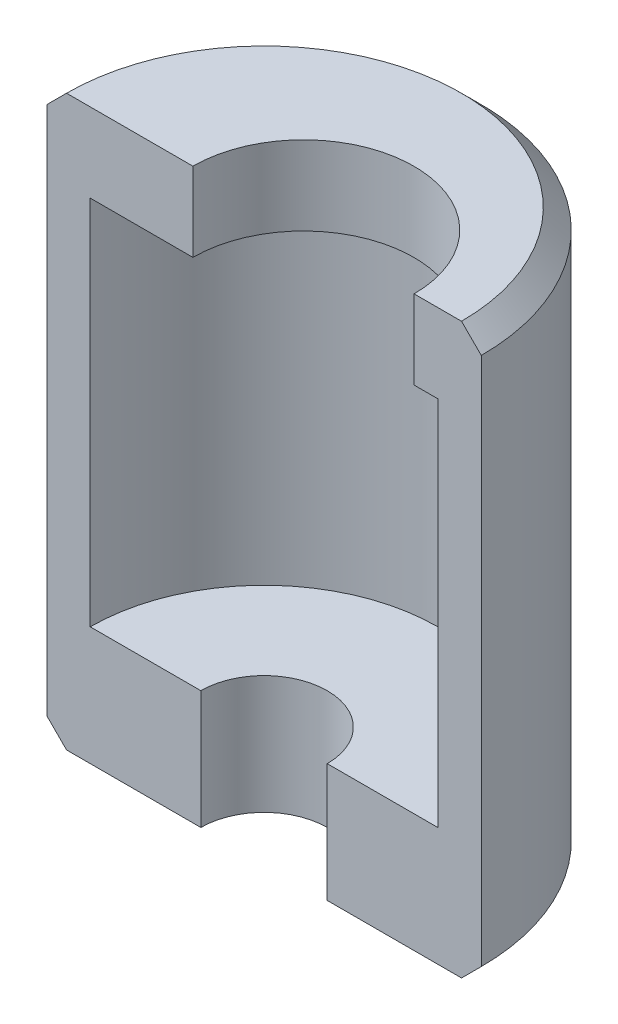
from build123d import *

# Parameters (mm, degrees)
ENL_V_MAT_EXTRU_1_REACH = 165.664
ESQUISSE2_R             = 28
CHANFREIN2_SIZE         = 5
ESQUISSE3_W             = 167.87507923
ESQUISSE3_H             = 158.553767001
ENL_V_MAT_EXTRU_2_DEPTH = 127.688594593


with BuildPart() as part:
    # Esquisse1 → R_volution1 (revolve)
    with BuildSketch(Plane.XY):
        Polygon((-16, -44), (-55, -44), (-55, 100), (0, 100), (0, 80), (-44, 80), (-44, -14), (-16, -14), align=None)
    revolve(axis=Axis((0, 80, 0), (0, 1, 0)))

    # Esquisse2 → Enl_v. mat.-Extru.1 (cut, up to next)
    with BuildSketch(Plane(origin=(0, 100, 0), x_dir=(-1, 0, 0), z_dir=(0, 1, 0)), mode=Mode.PRIVATE) as enl_v_mat_extru_1_sk1:
        with Locations((-9.99032139, 0.0244546)):
            Circle(ESQUISSE2_R)
    enl_v_mat_extru_1_tool1 = extrude(enl_v_mat_extru_1_sk1.sketch, amount=-ENL_V_MAT_EXTRU_1_REACH, mode=Mode.PRIVATE) & part.part
    add(enl_v_mat_extru_1_tool1.solids().sort_by_distance((9.990321, 100, 0.024455))[0], mode=Mode.SUBTRACT)

    # Chanfrein2
    chanfrein2_edges = [part.edges().sort_by_distance(p)[0] for p in [
        (55, -44, 0),
        (55, 100, 0),
    ]]
    chamfer(chanfrein2_edges, length=CHANFREIN2_SIZE)

    # Esquisse3 → Enl_v. mat.-Extru.2 (cut, through all)
    with BuildSketch(Plane.XY):
        with Locations((-4.860711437, 26.59446988)):
            Rectangle(ESQUISSE3_W, ESQUISSE3_H)
    extrude(amount=ENL_V_MAT_EXTRU_2_DEPTH, mode=Mode.SUBTRACT)


solid = part.part
